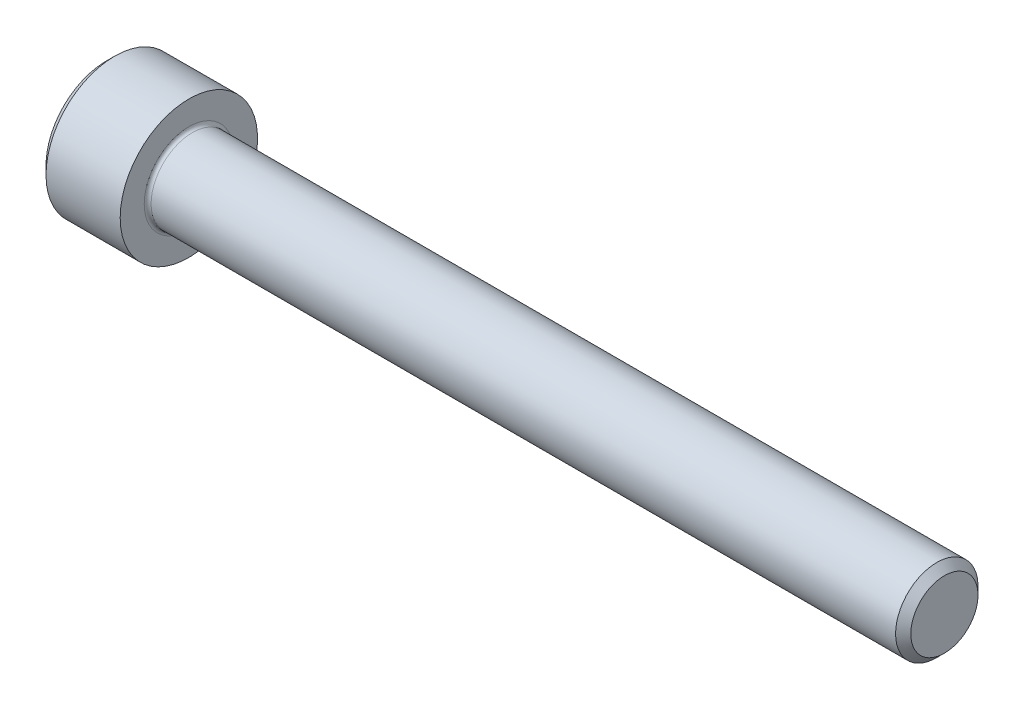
ISO-10303-21;
HEADER;
FILE_DESCRIPTION(('STEP AP214'),'2;1');
FILE_NAME('part.step','',(''),(''),'','','');
FILE_SCHEMA(('AUTOMOTIVE_DESIGN { 1 0 10303 214 1 1 1 1 }'));
ENDSEC;
DATA;
#1=APPLICATION_CONTEXT('core data for automotive mechanical design processes');
#2=APPLICATION_PROTOCOL_DEFINITION('international standard','automotive_design',2000,#1);
#3=PRODUCT_CONTEXT('',#1,'mechanical');
#4=PRODUCT('Part','Part','',(#3));
#5=PRODUCT_RELATED_PRODUCT_CATEGORY('part','',(#4));
#6=PRODUCT_DEFINITION_FORMATION('','',#4);
#7=PRODUCT_DEFINITION_CONTEXT('part definition',#1,'design');
#8=PRODUCT_DEFINITION('design','',#6,#7);
#9=PRODUCT_DEFINITION_SHAPE('','',#8);
#10=(LENGTH_UNIT() NAMED_UNIT(*) SI_UNIT(.MILLI.,.METRE.));
#11=(NAMED_UNIT(*) PLANE_ANGLE_UNIT() SI_UNIT($,.RADIAN.));
#12=(NAMED_UNIT(*) SI_UNIT($,.STERADIAN.) SOLID_ANGLE_UNIT());
#13=UNCERTAINTY_MEASURE_WITH_UNIT(LENGTH_MEASURE(1.E-05),#10,'distance_accuracy_value','');
#14=(GEOMETRIC_REPRESENTATION_CONTEXT(3) GLOBAL_UNCERTAINTY_ASSIGNED_CONTEXT((#13)) GLOBAL_UNIT_ASSIGNED_CONTEXT((#10,
#11,#12)) REPRESENTATION_CONTEXT('',''));
#15=CARTESIAN_POINT('',(0.,0.,0.));
#16=DIRECTION('',(0.,0.,1.));
#17=DIRECTION('',(1.,0.,0.));
#18=AXIS2_PLACEMENT_3D('',#15,#16,#17);
#19=CARTESIAN_POINT('',(3.,2.93524876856,0.));
#20=DIRECTION('',(1.,0.,0.));
#21=DIRECTION('',(0.,0.,-1.));
#22=AXIS2_PLACEMENT_3D('',#19,#20,#21);
#23=PLANE('',#22);
#24=DIRECTION('',(0.,1.,0.));
#25=VECTOR('',#24,1.);
#26=CARTESIAN_POINT('',(3.,2.93524876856,2.542));
#27=LINE('',#26,#25);
#28=CARTESIAN_POINT('',(2.99999999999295,3.14920181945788E-10,2.54200000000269));
#29=VERTEX_POINT('',#28);
#30=CARTESIAN_POINT('',(3.,-1.46762438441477,2.54199999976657));
#31=VERTEX_POINT('',#30);
#32=EDGE_CURVE('E96',#29,#31,#27,.F.);
#33=ORIENTED_EDGE('',*,*,#32,.F.);
#34=CARTESIAN_POINT('',(2.9999999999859,0.,0.));
#35=DIRECTION('',(-1.,0.,0.));
#36=DIRECTION('',(0.,0.,1.));
#37=AXIS2_PLACEMENT_3D('',#34,#35,#36);
#38=CIRCLE('',#37,2.54200000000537);
#39=CARTESIAN_POINT('',(2.99999999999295,-2.2014365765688,1.27099999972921));
#40=VERTEX_POINT('',#39);
#41=EDGE_CURVE('E98',#29,#40,#38,.F.);
#42=ORIENTED_EDGE('',*,*,#41,.T.);
#43=DIRECTION('',(0.,-0.499999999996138,-0.866025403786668));
#44=VECTOR('',#43,1.);
#45=CARTESIAN_POINT('',(3.,-1.46762438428,2.542));
#46=LINE('',#45,#44);
#47=EDGE_CURVE('E101',#31,#40,#46,.T.);
#48=ORIENTED_EDGE('',*,*,#47,.F.);
#49=EDGE_LOOP('',(#33,#42,#48));
#50=FACE_BOUND('',#49,.T.);
#51=ADVANCED_FACE('F17',(#50),#23,.F.);
#52=CARTESIAN_POINT('',(3.,2.93524876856,0.));
#53=DIRECTION('',(1.,0.,0.));
#54=DIRECTION('',(0.,0.,-1.));
#55=AXIS2_PLACEMENT_3D('',#52,#53,#54);
#56=PLANE('',#55);
#57=DIRECTION('',(0.,-0.500000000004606,-0.86602540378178));
#58=VECTOR('',#57,1.);
#59=CARTESIAN_POINT('',(3.,-2.20143657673,1.27099999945));
#60=LINE('',#59,#58);
#61=CARTESIAN_POINT('',(3.,-2.93524876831,2.61520596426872E-10));
#62=VERTEX_POINT('',#61);
#63=EDGE_CURVE('E169',#40,#62,#60,.T.);
#64=ORIENTED_EDGE('',*,*,#63,.F.);
#65=CARTESIAN_POINT('',(2.9999999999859,0.,0.));
#66=DIRECTION('',(-1.,0.,0.));
#67=DIRECTION('',(0.,0.,1.));
#68=AXIS2_PLACEMENT_3D('',#65,#66,#67);
#69=CIRCLE('',#68,2.54200000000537);
#70=CARTESIAN_POINT('',(2.99999999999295,-2.20143657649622,-1.27099999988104));
#71=VERTEX_POINT('',#70);
#72=EDGE_CURVE('E116',#40,#71,#69,.F.);
#73=ORIENTED_EDGE('',*,*,#72,.T.);
#74=DIRECTION('',(0.,0.499999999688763,-0.866025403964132));
#75=VECTOR('',#74,1.);
#76=CARTESIAN_POINT('',(3.,-2.93524876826,5.22184517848E-10));
#77=LINE('',#76,#75);
#78=EDGE_CURVE('E165',#62,#71,#77,.T.);
#79=ORIENTED_EDGE('',*,*,#78,.F.);
#80=EDGE_LOOP('',(#64,#73,#79));
#81=FACE_BOUND('',#80,.T.);
#82=ADVANCED_FACE('F341',(#81),#56,.F.);
#83=CARTESIAN_POINT('',(3.,2.93524876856,0.));
#84=DIRECTION('',(1.,0.,0.));
#85=DIRECTION('',(0.,0.,-1.));
#86=AXIS2_PLACEMENT_3D('',#83,#84,#85);
#87=PLANE('',#86);
#88=DIRECTION('',(0.,0.50000000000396,-0.866025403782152));
#89=VECTOR('',#88,1.);
#90=CARTESIAN_POINT('',(3.,-2.20143657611,-1.27100000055));
#91=LINE('',#90,#89);
#92=CARTESIAN_POINT('',(3.,-1.46762438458,-2.54199999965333));
#93=VERTEX_POINT('',#92);
#94=EDGE_CURVE('E161',#71,#93,#91,.T.);
#95=ORIENTED_EDGE('',*,*,#94,.F.);
#96=CARTESIAN_POINT('',(2.9999999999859,0.,0.));
#97=DIRECTION('',(-1.,0.,0.));
#98=DIRECTION('',(0.,0.,1.));
#99=AXIS2_PLACEMENT_3D('',#96,#97,#98);
#100=CIRCLE('',#99,2.54200000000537);
#101=CARTESIAN_POINT('',(2.9999999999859,-3.14923168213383E-10,-2.54199999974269));
#102=VERTEX_POINT('',#101);
#103=EDGE_CURVE('E218',#71,#102,#100,.F.);
#104=ORIENTED_EDGE('',*,*,#103,.T.);
#105=DIRECTION('',(0.,1.,0.));
#106=VECTOR('',#105,1.);
#107=CARTESIAN_POINT('',(3.,2.93524876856,-2.54199999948));
#108=LINE('',#107,#106);
#109=EDGE_CURVE('E157',#93,#102,#108,.T.);
#110=ORIENTED_EDGE('',*,*,#109,.F.);
#111=EDGE_LOOP('',(#95,#104,#110));
#112=FACE_BOUND('',#111,.T.);
#113=ADVANCED_FACE('F338',(#112),#87,.F.);
#114=CARTESIAN_POINT('',(3.,2.93524876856,0.));
#115=DIRECTION('',(1.,0.,0.));
#116=DIRECTION('',(0.,0.,-1.));
#117=AXIS2_PLACEMENT_3D('',#114,#115,#116);
#118=PLANE('',#117);
#119=DIRECTION('',(0.,1.,0.));
#120=VECTOR('',#119,1.);
#121=CARTESIAN_POINT('',(3.,2.93524876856,-2.542));
#122=LINE('',#121,#120);
#123=CARTESIAN_POINT('',(3.,1.46762438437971,-2.54199999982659));
#124=VERTEX_POINT('',#123);
#125=EDGE_CURVE('E153',#102,#124,#122,.T.);
#126=ORIENTED_EDGE('',*,*,#125,.F.);
#127=CARTESIAN_POINT('',(2.9999999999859,0.,0.));
#128=DIRECTION('',(-1.,0.,0.));
#129=DIRECTION('',(0.,0.,1.));
#130=AXIS2_PLACEMENT_3D('',#127,#128,#129);
#131=CIRCLE('',#130,2.54200000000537);
#132=CARTESIAN_POINT('',(2.99999999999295,2.20143657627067,-1.27100000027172));
#133=VERTEX_POINT('',#132);
#134=EDGE_CURVE('E215',#102,#133,#131,.F.);
#135=ORIENTED_EDGE('',*,*,#134,.T.);
#136=DIRECTION('',(0.,0.50000000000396,0.866025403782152));
#137=VECTOR('',#136,1.);
#138=CARTESIAN_POINT('',(3.,1.46762438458,-2.54199999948));
#139=LINE('',#138,#137);
#140=EDGE_CURVE('E149',#124,#133,#139,.T.);
#141=ORIENTED_EDGE('',*,*,#140,.F.);
#142=EDGE_LOOP('',(#126,#135,#141));
#143=FACE_BOUND('',#142,.T.);
#144=ADVANCED_FACE('F334',(#143),#118,.F.);
#145=CARTESIAN_POINT('',(3.,2.93524876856,0.));
#146=DIRECTION('',(1.,0.,0.));
#147=DIRECTION('',(0.,0.,-1.));
#148=AXIS2_PLACEMENT_3D('',#145,#146,#147);
#149=PLANE('',#148);
#150=DIRECTION('',(0.,0.49999999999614,0.866025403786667));
#151=VECTOR('',#150,1.);
#152=CARTESIAN_POINT('',(3.,2.20143657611,-1.27100000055));
#153=LINE('',#152,#151);
#154=CARTESIAN_POINT('',(3.,2.93524876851,-8.66067788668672E-11));
#155=VERTEX_POINT('',#154);
#156=EDGE_CURVE('E145',#133,#155,#153,.T.);
#157=ORIENTED_EDGE('',*,*,#156,.F.);
#158=CARTESIAN_POINT('',(2.9999999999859,0.,0.));
#159=DIRECTION('',(-1.,0.,0.));
#160=DIRECTION('',(0.,0.,1.));
#161=AXIS2_PLACEMENT_3D('',#158,#159,#160);
#162=CIRCLE('',#161,2.54200000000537);
#163=CARTESIAN_POINT('',(2.99999999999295,2.20143657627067,1.27100000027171));
#164=VERTEX_POINT('',#163);
#165=EDGE_CURVE('E124',#133,#164,#162,.F.);
#166=ORIENTED_EDGE('',*,*,#165,.T.);
#167=DIRECTION('',(0.,-0.499999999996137,0.866025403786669));
#168=VECTOR('',#167,1.);
#169=CARTESIAN_POINT('',(3.,2.93524876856,0.));
#170=LINE('',#169,#168);
#171=EDGE_CURVE('E117',#155,#164,#170,.T.);
#172=ORIENTED_EDGE('',*,*,#171,.F.);
#173=EDGE_LOOP('',(#157,#166,#172));
#174=FACE_BOUND('',#173,.T.);
#175=ADVANCED_FACE('F330',(#174),#149,.F.);
#176=CARTESIAN_POINT('',(2.9999999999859,0.,0.));
#177=DIRECTION('',(-1.,0.,0.));
#178=DIRECTION('',(0.,0.,1.));
#179=AXIS2_PLACEMENT_3D('',#176,#177,#178);
#180=CONICAL_SURFACE('',#179,2.54200000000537,1.0471975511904);
#181=CARTESIAN_POINT('',(4.46762438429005,0.,0.));
#182=VERTEX_POINT('',#181);
#183=VERTEX_LOOP('',#182);
#184=FACE_BOUND('',#183,.T.);
#185=ORIENTED_EDGE('',*,*,#41,.F.);
#186=CARTESIAN_POINT('',(2.9999999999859,0.,0.));
#187=DIRECTION('',(-1.,0.,0.));
#188=DIRECTION('',(0.,0.,1.));
#189=AXIS2_PLACEMENT_3D('',#186,#187,#188);
#190=CIRCLE('',#189,2.54200000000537);
#191=EDGE_CURVE('E112',#29,#164,#190,.T.);
#192=ORIENTED_EDGE('',*,*,#191,.T.);
#193=ORIENTED_EDGE('',*,*,#165,.F.);
#194=ORIENTED_EDGE('',*,*,#134,.F.);
#195=ORIENTED_EDGE('',*,*,#103,.F.);
#196=ORIENTED_EDGE('',*,*,#72,.F.);
#197=EDGE_LOOP('',(#185,#192,#193,#194,#195,#196));
#198=FACE_BOUND('',#197,.T.);
#199=ADVANCED_FACE('F110',(#184,#198),#180,.F.);
#200=CARTESIAN_POINT('',(3.,2.93524876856,0.));
#201=DIRECTION('',(1.,0.,0.));
#202=DIRECTION('',(0.,0.,-1.));
#203=AXIS2_PLACEMENT_3D('',#200,#201,#202);
#204=PLANE('',#203);
#205=DIRECTION('',(0.,0.50000000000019,-0.866025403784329));
#206=VECTOR('',#205,1.);
#207=CARTESIAN_POINT('',(3.,2.93524876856,0.));
#208=LINE('',#207,#206);
#209=CARTESIAN_POINT('',(3.,1.46762438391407,2.54200000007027));
#210=VERTEX_POINT('',#209);
#211=EDGE_CURVE('E123',#164,#210,#208,.F.);
#212=ORIENTED_EDGE('',*,*,#211,.F.);
#213=ORIENTED_EDGE('',*,*,#191,.F.);
#214=DIRECTION('',(0.,-1.,0.));
#215=VECTOR('',#214,1.);
#216=CARTESIAN_POINT('',(3.,-1.46762438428,2.542));
#217=LINE('',#216,#215);
#218=EDGE_CURVE('E121',#29,#210,#217,.F.);
#219=ORIENTED_EDGE('',*,*,#218,.T.);
#220=EDGE_LOOP('',(#212,#213,#219));
#221=FACE_BOUND('',#220,.T.);
#222=ADVANCED_FACE('F120',(#221),#204,.F.);
#223=CARTESIAN_POINT('',(3.,2.93524876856,0.));
#224=DIRECTION('',(0.,-0.866025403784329,-0.50000000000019));
#225=DIRECTION('',(0.,0.50000000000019,-0.866025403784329));
#226=AXIS2_PLACEMENT_3D('',#223,#224,#225);
#227=PLANE('',#226);
#228=ORIENTED_EDGE('',*,*,#211,.T.);
#229=DIRECTION('',(1.,0.,0.));
#230=VECTOR('',#229,1.);
#231=CARTESIAN_POINT('',(3.,1.46762438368,2.542));
#232=LINE('',#231,#230);
#233=CARTESIAN_POINT('',(0.,1.46762438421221,2.54199999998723));
#234=VERTEX_POINT('',#233);
#235=EDGE_CURVE('E129',#210,#234,#232,.F.);
#236=ORIENTED_EDGE('',*,*,#235,.T.);
#237=DIRECTION('',(0.,-0.499999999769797,0.866025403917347));
#238=VECTOR('',#237,1.);
#239=CARTESIAN_POINT('',(0.,2.93524876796,0.));
#240=LINE('',#239,#238);
#241=CARTESIAN_POINT('',(0.,2.9352487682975,6.49506382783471E-11));
#242=VERTEX_POINT('',#241);
#243=EDGE_CURVE('E136',#242,#234,#240,.T.);
#244=ORIENTED_EDGE('',*,*,#243,.F.);
#245=DIRECTION('',(1.,0.,0.));
#246=VECTOR('',#245,1.);
#247=CARTESIAN_POINT('',(3.,2.93524876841,-2.5980895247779E-10));
#248=LINE('',#247,#246);
#249=EDGE_CURVE('E180',#242,#155,#248,.T.);
#250=ORIENTED_EDGE('',*,*,#249,.T.);
#251=ORIENTED_EDGE('',*,*,#171,.T.);
#252=EDGE_LOOP('',(#228,#236,#244,#250,#251));
#253=FACE_BOUND('',#252,.T.);
#254=ADVANCED_FACE('F322',(#253),#227,.T.);
#255=CARTESIAN_POINT('',(3.,-1.46762438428,2.542));
#256=DIRECTION('',(0.,0.,1.));
#257=DIRECTION('',(0.,-1.,0.));
#258=AXIS2_PLACEMENT_3D('',#255,#256,#257);
#259=PLANE('',#258);
#260=ORIENTED_EDGE('',*,*,#235,.F.);
#261=ORIENTED_EDGE('',*,*,#218,.F.);
#262=ORIENTED_EDGE('',*,*,#32,.T.);
#263=DIRECTION('',(1.,0.,0.));
#264=VECTOR('',#263,1.);
#265=CARTESIAN_POINT('',(3.,-1.46762438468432,2.5419999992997));
#266=LINE('',#265,#264);
#267=CARTESIAN_POINT('',(0.,-1.46762438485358,2.54199999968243));
#268=VERTEX_POINT('',#267);
#269=EDGE_CURVE('E131',#268,#31,#266,.T.);
#270=ORIENTED_EDGE('',*,*,#269,.F.);
#271=DIRECTION('',(0.,1.,0.));
#272=VECTOR('',#271,1.);
#273=CARTESIAN_POINT('',(0.,0.,2.54199999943));
#274=LINE('',#273,#272);
#275=EDGE_CURVE('E364',#234,#268,#274,.F.);
#276=ORIENTED_EDGE('',*,*,#275,.F.);
#277=EDGE_LOOP('',(#260,#261,#262,#270,#276));
#278=FACE_BOUND('',#277,.T.);
#279=ADVANCED_FACE('F127',(#278),#259,.F.);
#280=CARTESIAN_POINT('',(3.,-1.46762438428,2.542));
#281=DIRECTION('',(0.,0.866025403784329,-0.50000000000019));
#282=DIRECTION('',(0.,0.50000000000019,0.866025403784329));
#283=AXIS2_PLACEMENT_3D('',#280,#281,#282);
#284=PLANE('',#283);
#285=ORIENTED_EDGE('',*,*,#63,.T.);
#286=DIRECTION('',(1.,0.,0.));
#287=VECTOR('',#286,1.);
#288=CARTESIAN_POINT('',(3.,-2.93524876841,-2.59807231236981E-10));
#289=LINE('',#288,#287);
#290=CARTESIAN_POINT('',(0.,-2.93524876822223,1.95986312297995E-10));
#291=VERTEX_POINT('',#290);
#292=EDGE_CURVE('E191',#291,#62,#289,.T.);
#293=ORIENTED_EDGE('',*,*,#292,.F.);
#294=DIRECTION('',(0.,-0.499999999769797,-0.866025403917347));
#295=VECTOR('',#294,1.);
#296=CARTESIAN_POINT('',(0.,-1.46762438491,2.54199999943));
#297=LINE('',#296,#295);
#298=EDGE_CURVE('E359',#268,#291,#297,.T.);
#299=ORIENTED_EDGE('',*,*,#298,.F.);
#300=ORIENTED_EDGE('',*,*,#269,.T.);
#301=ORIENTED_EDGE('',*,*,#47,.T.);
#302=EDGE_LOOP('',(#285,#293,#299,#300,#301));
#303=FACE_BOUND('',#302,.T.);
#304=ADVANCED_FACE('F315',(#303),#284,.T.);
#305=CARTESIAN_POINT('',(3.,-2.93524876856,0.));
#306=DIRECTION('',(0.,0.866025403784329,0.50000000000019));
#307=DIRECTION('',(0.,-0.50000000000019,0.866025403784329));
#308=AXIS2_PLACEMENT_3D('',#305,#306,#307);
#309=PLANE('',#308);
#310=ORIENTED_EDGE('',*,*,#94,.T.);
#311=DIRECTION('',(1.,0.,0.));
#312=VECTOR('',#311,1.);
#313=CARTESIAN_POINT('',(3.,-1.46762438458,-2.542));
#314=LINE('',#313,#312);
#315=CARTESIAN_POINT('',(0.,-1.46762438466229,-2.54199999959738));
#316=VERTEX_POINT('',#315);
#317=EDGE_CURVE('E184',#93,#316,#314,.F.);
#318=ORIENTED_EDGE('',*,*,#317,.T.);
#319=DIRECTION('',(0.,0.499999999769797,-0.866025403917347));
#320=VECTOR('',#319,1.);
#321=CARTESIAN_POINT('',(0.,-2.93524876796,0.));
#322=LINE('',#321,#320);
#323=EDGE_CURVE('E353',#291,#316,#322,.T.);
#324=ORIENTED_EDGE('',*,*,#323,.F.);
#325=ORIENTED_EDGE('',*,*,#292,.T.);
#326=ORIENTED_EDGE('',*,*,#78,.T.);
#327=EDGE_LOOP('',(#310,#318,#324,#325,#326));
#328=FACE_BOUND('',#327,.T.);
#329=ADVANCED_FACE('F311',(#328),#309,.T.);
#330=CARTESIAN_POINT('',(3.,1.46762438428,-2.542));
#331=DIRECTION('',(0.,0.,-1.));
#332=DIRECTION('',(0.,1.,0.));
#333=AXIS2_PLACEMENT_3D('',#330,#331,#332);
#334=PLANE('',#333);
#335=ORIENTED_EDGE('',*,*,#317,.F.);
#336=ORIENTED_EDGE('',*,*,#109,.T.);
#337=ORIENTED_EDGE('',*,*,#125,.T.);
#338=DIRECTION('',(1.,0.,0.));
#339=VECTOR('',#338,1.);
#340=CARTESIAN_POINT('',(3.,1.46762438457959,-2.54199999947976));
#341=LINE('',#340,#339);
#342=CARTESIAN_POINT('',(0.,1.4676243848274,-2.54199999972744));
#343=VERTEX_POINT('',#342);
#344=EDGE_CURVE('E183',#124,#343,#341,.F.);
#345=ORIENTED_EDGE('',*,*,#344,.T.);
#346=DIRECTION('',(0.,1.,0.));
#347=VECTOR('',#346,1.);
#348=CARTESIAN_POINT('',(0.,0.,-2.54199999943));
#349=LINE('',#348,#347);
#350=EDGE_CURVE('E358',#316,#343,#349,.T.);
#351=ORIENTED_EDGE('',*,*,#350,.F.);
#352=EDGE_LOOP('',(#335,#336,#337,#345,#351));
#353=FACE_BOUND('',#352,.T.);
#354=ADVANCED_FACE('F307',(#353),#334,.F.);
#355=CARTESIAN_POINT('',(3.,2.93524876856,0.));
#356=DIRECTION('',(0.,0.866025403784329,-0.50000000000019));
#357=DIRECTION('',(0.,0.50000000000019,0.866025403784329));
#358=AXIS2_PLACEMENT_3D('',#355,#356,#357);
#359=PLANE('',#358);
#360=ORIENTED_EDGE('',*,*,#344,.F.);
#361=ORIENTED_EDGE('',*,*,#140,.T.);
#362=ORIENTED_EDGE('',*,*,#156,.T.);
#363=ORIENTED_EDGE('',*,*,#249,.F.);
#364=DIRECTION('',(0.,0.499999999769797,0.866025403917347));
#365=VECTOR('',#364,1.);
#366=CARTESIAN_POINT('',(0.,1.46762438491,-2.54199999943));
#367=LINE('',#366,#365);
#368=EDGE_CURVE('E211',#343,#242,#367,.T.);
#369=ORIENTED_EDGE('',*,*,#368,.F.);
#370=EDGE_LOOP('',(#360,#361,#362,#363,#369));
#371=FACE_BOUND('',#370,.T.);
#372=ADVANCED_FACE('F303',(#371),#359,.F.);
#373=CARTESIAN_POINT('',(0.,0.,0.));
#374=DIRECTION('',(-1.,0.,0.));
#375=DIRECTION('',(0.,0.,1.));
#376=AXIS2_PLACEMENT_3D('',#373,#374,#375);
#377=PLANE('',#376);
#378=ORIENTED_EDGE('',*,*,#350,.T.);
#379=ORIENTED_EDGE('',*,*,#368,.T.);
#380=ORIENTED_EDGE('',*,*,#243,.T.);
#381=ORIENTED_EDGE('',*,*,#275,.T.);
#382=ORIENTED_EDGE('',*,*,#298,.T.);
#383=ORIENTED_EDGE('',*,*,#323,.T.);
#384=EDGE_LOOP('',(#378,#379,#380,#381,#382,#383));
#385=FACE_BOUND('',#384,.T.);
#386=CARTESIAN_POINT('',(0.,0.,0.));
#387=DIRECTION('',(1.,0.,0.));
#388=DIRECTION('',(0.,0.,-1.));
#389=AXIS2_PLACEMENT_3D('',#386,#387,#388);
#390=CIRCLE('',#389,4.39999999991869);
#391=CARTESIAN_POINT('',(0.,0.,-4.39999999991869));
#392=VERTEX_POINT('',#391);
#393=EDGE_CURVE('E209',#392,#392,#390,.T.);
#394=ORIENTED_EDGE('',*,*,#393,.F.);
#395=EDGE_LOOP('',(#394));
#396=FACE_BOUND('',#395,.T.);
#397=ADVANCED_FACE('F295',(#385,#396),#377,.T.);
#398=CARTESIAN_POINT('',(0.599999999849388,0.,0.));
#399=DIRECTION('',(1.,0.,0.));
#400=DIRECTION('',(0.,0.,-1.));
#401=AXIS2_PLACEMENT_3D('',#398,#399,#400);
#402=CONICAL_SURFACE('',#401,4.99999999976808,0.785398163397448);
#403=ORIENTED_EDGE('',*,*,#393,.T.);
#404=EDGE_LOOP('',(#403));
#405=FACE_BOUND('',#404,.T.);
#406=CARTESIAN_POINT('',(0.600000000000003,0.,0.));
#407=DIRECTION('',(-1.,0.,0.));
#408=DIRECTION('',(0.,0.,1.));
#409=AXIS2_PLACEMENT_3D('',#406,#407,#408);
#410=CIRCLE('',#409,5.);
#411=CARTESIAN_POINT('',(0.600000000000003,0.,5.));
#412=VERTEX_POINT('',#411);
#413=EDGE_CURVE('E208',#412,#412,#410,.F.);
#414=ORIENTED_EDGE('',*,*,#413,.F.);
#415=EDGE_LOOP('',(#414));
#416=FACE_BOUND('',#415,.T.);
#417=ADVANCED_FACE('F290',(#405,#416),#402,.T.);
#418=CARTESIAN_POINT('',(-31.75,0.,0.));
#419=DIRECTION('',(-1.,0.,0.));
#420=DIRECTION('',(0.,0.,1.));
#421=AXIS2_PLACEMENT_3D('',#418,#419,#420);
#422=CYLINDRICAL_SURFACE('',#421,5.);
#423=CARTESIAN_POINT('',(6.,0.,0.));
#424=DIRECTION('',(-1.,0.,0.));
#425=DIRECTION('',(0.,0.,1.));
#426=AXIS2_PLACEMENT_3D('',#423,#424,#425);
#427=CIRCLE('',#426,5.);
#428=CARTESIAN_POINT('',(6.,0.,5.));
#429=VERTEX_POINT('',#428);
#430=EDGE_CURVE('E205',#429,#429,#427,.F.);
#431=ORIENTED_EDGE('',*,*,#430,.F.);
#432=EDGE_LOOP('',(#431));
#433=FACE_BOUND('',#432,.T.);
#434=ORIENTED_EDGE('',*,*,#413,.T.);
#435=EDGE_LOOP('',(#434));
#436=FACE_BOUND('',#435,.T.);
#437=ADVANCED_FACE('F286',(#433,#436),#422,.T.);
#438=CARTESIAN_POINT('',(61.,2.4455,0.));
#439=DIRECTION('',(1.,0.,0.));
#440=DIRECTION('',(0.,0.,-1.));
#441=AXIS2_PLACEMENT_3D('',#438,#439,#440);
#442=PLANE('',#441);
#443=CARTESIAN_POINT('',(60.9999999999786,0.,0.));
#444=DIRECTION('',(-1.,0.,0.));
#445=DIRECTION('',(0.,0.,1.));
#446=AXIS2_PLACEMENT_3D('',#443,#444,#445);
#447=CIRCLE('',#446,2.4454999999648);
#448=CARTESIAN_POINT('',(60.9999999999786,0.,2.4454999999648));
#449=VERTEX_POINT('',#448);
#450=EDGE_CURVE('E201',#449,#449,#447,.T.);
#451=ORIENTED_EDGE('',*,*,#450,.F.);
#452=EDGE_LOOP('',(#451));
#453=FACE_BOUND('',#452,.T.);
#454=ADVANCED_FACE('F245',(#453),#442,.T.);
#455=CARTESIAN_POINT('',(6.,5.,0.));
#456=DIRECTION('',(1.,0.,0.));
#457=DIRECTION('',(0.,0.,-1.));
#458=AXIS2_PLACEMENT_3D('',#455,#456,#457);
#459=PLANE('',#458);
#460=CARTESIAN_POINT('',(6.,0.,3.25));
#461=CARTESIAN_POINT('',(6.00000000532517,-0.0425763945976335,3.24998718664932));
#462=CARTESIAN_POINT('',(6.00000000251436,-0.0851521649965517,3.24914609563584));
#463=CARTESIAN_POINT('',(5.99999999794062,-0.170236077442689,3.24581345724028));
#464=CARTESIAN_POINT('',(5.99999999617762,-0.212744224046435,3.24332202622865));
#465=CARTESIAN_POINT('',(6.00000001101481,-0.297630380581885,3.23669497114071));
#466=CARTESIAN_POINT('',(6.00000002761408,-0.340008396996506,3.23255943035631));
#467=CARTESIAN_POINT('',(6.00000007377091,-0.424568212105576,3.22263708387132));
#468=CARTESIAN_POINT('',(6.00000010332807,-0.46675001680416,3.2168503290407));
#469=CARTESIAN_POINT('',(6.0000003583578,-0.550866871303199,3.20368621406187));
#470=CARTESIAN_POINT('',(6.00000058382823,-0.592801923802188,3.19630887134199));
#471=CARTESIAN_POINT('',(6.00000074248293,-0.660206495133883,3.18296934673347));
#472=CARTESIAN_POINT('',(6.00000075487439,-0.685786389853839,3.17755934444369));
#473=CARTESIAN_POINT('',(6.00000070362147,-0.757853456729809,3.16137245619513));
#474=CARTESIAN_POINT('',(6.00000056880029,-0.804175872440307,3.1498505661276));
#475=CARTESIAN_POINT('',(6.00000037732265,-0.881045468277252,3.12891688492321));
#476=CARTESIAN_POINT('',(6.0000003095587,-0.911747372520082,3.12006594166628));
#477=CARTESIAN_POINT('',(6.00000019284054,-0.971970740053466,3.10173621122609));
#478=CARTESIAN_POINT('',(6.00000014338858,-1.00150022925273,3.09228379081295));
#479=CARTESIAN_POINT('',(6.00000004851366,-1.07595008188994,3.06727588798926));
#480=CARTESIAN_POINT('',(6.00000001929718,-1.12068186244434,3.05115352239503));
#481=CARTESIAN_POINT('',(6.00000000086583,-1.19139695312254,3.0239206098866));
#482=CARTESIAN_POINT('',(6.00000000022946,-1.21762221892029,3.01343120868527));
#483=CARTESIAN_POINT('',(5.99999999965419,-1.28303073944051,2.98630750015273));
#484=CARTESIAN_POINT('',(6.00000000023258,-1.3220416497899,2.96925430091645));
#485=CARTESIAN_POINT('',(5.99999999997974,-1.39936413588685,2.93363820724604));
#486=CARTESIAN_POINT('',(5.9999999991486,-1.43767575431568,2.91507540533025));
#487=CARTESIAN_POINT('',(6.00000002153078,-1.51355069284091,2.87648154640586));
#488=CARTESIAN_POINT('',(6.00000004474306,-1.55111404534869,2.85645055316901));
#489=CARTESIAN_POINT('',(6.00000010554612,-1.62542686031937,2.81493620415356));
#490=CARTESIAN_POINT('',(6.00000014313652,-1.66217634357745,2.79345288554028));
#491=CARTESIAN_POINT('',(6.00000041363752,-1.73483768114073,2.74910938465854));
#492=CARTESIAN_POINT('',(6.0000006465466,-1.77074954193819,2.72624921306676));
#493=CARTESIAN_POINT('',(6.00000080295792,-1.8279586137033,2.68810209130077));
#494=CARTESIAN_POINT('',(6.00000081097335,-1.84956797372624,2.67328132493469));
#495=CARTESIAN_POINT('',(6.00000074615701,-1.90998924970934,2.63071737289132));
#496=CARTESIAN_POINT('',(6.00000060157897,-1.94836508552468,2.60235080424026));
#497=CARTESIAN_POINT('',(6.00000039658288,-2.01133484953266,2.55361779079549));
#498=CARTESIAN_POINT('',(6.00000032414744,-2.03628666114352,2.53371064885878));
#499=CARTESIAN_POINT('',(6.00000020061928,-2.08465109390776,2.49394203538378));
#500=CARTESIAN_POINT('',(6.00000014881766,-2.10808611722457,2.47410780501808));
#501=CARTESIAN_POINT('',(6.00000004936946,-2.16697759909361,2.42282018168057));
#502=CARTESIAN_POINT('',(6.0000000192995,-2.20204149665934,2.39091337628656));
#503=CARTESIAN_POINT('',(6.0000000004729,-2.25722218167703,2.338479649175));
#504=CARTESIAN_POINT('',(6.00000000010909,-2.27778663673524,2.31842030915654));
#505=CARTESIAN_POINT('',(5.99999999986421,-2.32817760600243,2.26798939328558));
#506=CARTESIAN_POINT('',(6.00000000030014,-2.35769325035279,2.23730550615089));
#507=CARTESIAN_POINT('',(5.99999999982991,-2.41550068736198,2.17481052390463));
#508=CARTESIAN_POINT('',(5.99999999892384,-2.44379255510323,2.14299949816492));
#509=CARTESIAN_POINT('',(6.00000002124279,-2.49912306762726,2.07830732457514));
#510=CARTESIAN_POINT('',(6.00000004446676,-2.52616176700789,2.0454262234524));
#511=CARTESIAN_POINT('',(6.00000010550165,-2.5789314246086,1.97863366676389));
#512=CARTESIAN_POINT('',(6.00000014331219,-2.60466241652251,1.94472223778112));
#513=CARTESIAN_POINT('',(6.00000041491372,-2.65482362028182,1.87594786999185));
#514=CARTESIAN_POINT('',(6.00000064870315,-2.67925384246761,1.84108493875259));
#515=CARTESIAN_POINT('',(6.00000080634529,-2.71752290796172,1.78392958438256));
#516=CARTESIAN_POINT('',(6.00000081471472,-2.73182804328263,1.7619480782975));
#517=CARTESIAN_POINT('',(6.00000075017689,-2.77136804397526,1.69948869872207));
#518=CARTESIAN_POINT('',(6.00000060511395,-2.79596216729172,1.65860224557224));
#519=CARTESIAN_POINT('',(6.00000039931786,-2.83547615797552,1.58950167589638));
#520=CARTESIAN_POINT('',(6.00000032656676,-2.85090253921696,1.56157499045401));
#521=CARTESIAN_POINT('',(6.00000020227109,-2.88038482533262,1.50629086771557));
#522=CARTESIAN_POINT('',(6.00000015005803,-2.89447006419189,1.47894907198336));
#523=CARTESIAN_POINT('',(6.00000004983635,-2.92928428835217,1.40895374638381));
#524=CARTESIAN_POINT('',(6.00000001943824,-2.94947738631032,1.36603173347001));
#525=CARTESIAN_POINT('',(6.00000000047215,-2.980363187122,1.29652211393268));
#526=CARTESIAN_POINT('',(6.00000000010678,-2.99165160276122,1.2701965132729));
#527=CARTESIAN_POINT('',(5.99999999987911,-3.01887545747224,1.20439693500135));
#528=CARTESIAN_POINT('',(6.00000000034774,-3.03440220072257,1.16475256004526));
#529=CARTESIAN_POINT('',(5.99999999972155,-3.06389369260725,1.08489082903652));
#530=CARTESIAN_POINT('',(5.99999999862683,-3.07785853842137,1.04467350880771));
#531=CARTESIAN_POINT('',(6.0000000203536,-3.1042209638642,0.963729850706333));
#532=CARTESIAN_POINT('',(6.00000004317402,-3.11661861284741,0.923003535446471));
#533=CARTESIAN_POINT('',(6.00000010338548,-3.13981148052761,0.841099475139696));
#534=CARTESIAN_POINT('',(6.00000014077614,-3.15060674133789,0.799921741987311));
#535=CARTESIAN_POINT('',(6.00000041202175,-3.17063151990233,0.7171850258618));
#536=CARTESIAN_POINT('',(6.00000064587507,-3.17986105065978,0.675626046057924));
#537=CARTESIAN_POINT('',(6.00000080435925,-3.19334420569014,0.60818018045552));
#538=CARTESIAN_POINT('',(6.00000081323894,-3.19814778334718,0.58240213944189));
#539=CARTESIAN_POINT('',(6.00000075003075,-3.21077584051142,0.509569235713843));
#540=CARTESIAN_POINT('',(6.00000060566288,-3.21785180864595,0.462382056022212));
#541=CARTESIAN_POINT('',(6.00000040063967,-3.22791536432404,0.383415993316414));
#542=CARTESIAN_POINT('',(6.00000032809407,-3.23148088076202,0.351708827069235));
#543=CARTESIAN_POINT('',(6.00000020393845,-3.23756532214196,0.289325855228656));
#544=CARTESIAN_POINT('',(6.00000015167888,-3.2401167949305,0.258653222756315));
#545=CARTESIAN_POINT('',(6.00000005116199,-3.2454956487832,0.180630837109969));
#546=CARTESIAN_POINT('',(6.00000002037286,-3.24772521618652,0.133238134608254));
#547=CARTESIAN_POINT('',(6.0000000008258,-3.24965765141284,0.0572242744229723));
#548=CARTESIAN_POINT('',(6.00000000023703,-3.25001209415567,0.0286172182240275));
#549=CARTESIAN_POINT('',(5.99999999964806,-3.2499815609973,-0.04248820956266));
#550=CARTESIAN_POINT('',(6.00000000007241,-3.2491540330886,-0.0849876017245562));
#551=CARTESIAN_POINT('',(6.00000000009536,-3.24583280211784,-0.169919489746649));
#552=CARTESIAN_POINT('',(5.99999999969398,-3.2433391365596,-0.21235198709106));
#553=CARTESIAN_POINT('',(6.00000000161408,-3.2367026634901,-0.29708735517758));
#554=CARTESIAN_POINT('',(6.00000000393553,-3.23255987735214,-0.339390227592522));
#555=CARTESIAN_POINT('',(6.00000001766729,-3.22262781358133,-0.423802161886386));
#556=CARTESIAN_POINT('',(6.00000002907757,-3.21683854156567,-0.465911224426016));
#557=CARTESIAN_POINT('',(6.00000007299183,-3.20362391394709,-0.549871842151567));
#558=CARTESIAN_POINT('',(6.00000010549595,-3.19619854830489,-0.591723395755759));
#559=CARTESIAN_POINT('',(6.00000020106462,-3.17972020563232,-0.675106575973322));
#560=CARTESIAN_POINT('',(6.00000026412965,-3.17066720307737,-0.716638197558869));
#561=CARTESIAN_POINT('',(6.00000041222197,-3.15558247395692,-0.779912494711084));
#562=CARTESIAN_POINT('',(6.00000047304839,-3.1501270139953,-0.80179405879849));
#563=CARTESIAN_POINT('',(6.00000058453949,-3.13939550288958,-0.842980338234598));
#564=CARTESIAN_POINT('',(6.00000063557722,-3.13416840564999,-0.86229780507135));
#565=CARTESIAN_POINT('',(6.00000073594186,-3.11722263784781,-0.922594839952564));
#566=CARTESIAN_POINT('',(6.0000007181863,-3.10484202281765,-0.96339002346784));
#567=CARTESIAN_POINT('',(6.00000052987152,-3.07845495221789,-1.044435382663));
#568=CARTESIAN_POINT('',(6.00000035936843,-3.06444909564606,-1.08468575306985));
#569=CARTESIAN_POINT('',(6.00000011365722,-3.03774347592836,-1.1563777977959));
#570=CARTESIAN_POINT('',(6.00000002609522,-3.02536174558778,-1.18793860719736));
#571=CARTESIAN_POINT('',(5.99999998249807,-3.00394912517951,-1.24062569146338));
#572=CARTESIAN_POINT('',(5.99999999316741,-2.99512444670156,-1.26183655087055));
#573=CARTESIAN_POINT('',(6.00000001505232,-2.96859722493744,-1.32374030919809));
#574=CARTESIAN_POINT('',(6.00000001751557,-2.95028340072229,-1.36417266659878));
#575=CARTESIAN_POINT('',(6.00000009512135,-2.90003187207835,-1.46937358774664));
#576=CARTESIAN_POINT('',(6.00000021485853,-2.86675076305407,-1.53350843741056));
#577=CARTESIAN_POINT('',(6.0000004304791,-2.81359206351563,-1.62804969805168));
#578=CARTESIAN_POINT('',(6.00000050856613,-2.79528928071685,-1.65935341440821));
#579=CARTESIAN_POINT('',(6.00000062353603,-2.75544976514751,-1.72489642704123));
#580=CARTESIAN_POINT('',(6.00000065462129,-2.73378362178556,-1.75905741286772));
#581=CARTESIAN_POINT('',(6.0000006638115,-2.68813763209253,-1.82810046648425));
#582=CARTESIAN_POINT('',(6.00000063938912,-2.66409706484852,-1.86294235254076));
#583=CARTESIAN_POINT('',(6.00000054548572,-2.61356034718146,-1.93317248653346));
#584=CARTESIAN_POINT('',(6.00000047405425,-2.58700257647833,-1.96851642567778));
#585=CARTESIAN_POINT('',(6.00000030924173,-2.53247045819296,-2.03804096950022));
#586=CARTESIAN_POINT('',(6.00000021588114,-2.50449744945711,-2.0722226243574));
#587=CARTESIAN_POINT('',(6.00000009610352,-2.45051494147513,-2.13552493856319));
#588=CARTESIAN_POINT('',(6.00000006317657,-2.42465415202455,-2.16477267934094));
#589=CARTESIAN_POINT('',(6.00000002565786,-2.37107679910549,-2.22326121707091));
#590=CARTESIAN_POINT('',(6.00000002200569,-2.34332733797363,-2.25247189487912));
#591=CARTESIAN_POINT('',(6.00000002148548,-2.28486478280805,-2.31179750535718));
#592=CARTESIAN_POINT('',(6.00000002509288,-2.25407817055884,-2.34184002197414));
#593=CARTESIAN_POINT('',(6.00000004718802,-2.18936309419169,-2.40256016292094));
#594=CARTESIAN_POINT('',(6.00000006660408,-2.15535915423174,-2.43315742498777));
#595=CARTESIAN_POINT('',(6.0000001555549,-2.08941207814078,-2.49005958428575));
#596=CARTESIAN_POINT('',(6.00000022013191,-2.05758179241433,-2.51649551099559));
#597=CARTESIAN_POINT('',(6.00000039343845,-1.98679960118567,-2.57302563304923));
#598=CARTESIAN_POINT('',(6.00000050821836,-1.9476418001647,-2.60286295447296));
#599=CARTESIAN_POINT('',(6.00000065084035,-1.8733768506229,-2.65678123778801));
#600=CARTESIAN_POINT('',(6.00000068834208,-1.8384382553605,-2.68109490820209));
#601=CARTESIAN_POINT('',(6.00000070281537,-1.76801423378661,-2.72804875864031));
#602=CARTESIAN_POINT('',(6.00000068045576,-1.73253921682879,-2.750704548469));
#603=CARTESIAN_POINT('',(6.00000056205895,-1.65608539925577,-2.79742527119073));
#604=CARTESIAN_POINT('',(6.00000045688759,-1.61498704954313,-2.8212948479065));
#605=CARTESIAN_POINT('',(6.00000026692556,-1.53093339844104,-2.86766341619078));
#606=CARTESIAN_POINT('',(6.00000018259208,-1.48795733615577,-2.89012473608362));
#607=CARTESIAN_POINT('',(6.000000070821,-1.40051501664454,-2.9333855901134));
#608=CARTESIAN_POINT('',(6.00000004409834,-1.35603691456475,-2.9541611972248));
#609=CARTESIAN_POINT('',(6.00000001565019,-1.27356782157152,-2.99045190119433));
#610=CARTESIAN_POINT('',(6.00000001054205,-1.2357101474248,-3.00627076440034));
#611=CARTESIAN_POINT('',(6.00000000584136,-1.16691980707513,-3.03352162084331));
#612=CARTESIAN_POINT('',(6.00000000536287,-1.13608670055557,-3.04520516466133));
#613=CARTESIAN_POINT('',(6.00000001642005,-1.0941250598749,-3.06041100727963));
#614=CARTESIAN_POINT('',(6.000000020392,-1.08313848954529,-3.06432837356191));
#615=CARTESIAN_POINT('',(6.00000003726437,-1.04921840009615,-3.07622035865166));
#616=CARTESIAN_POINT('',(6.00000005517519,-1.02621634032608,-3.08400033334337));
#617=CARTESIAN_POINT('',(6.00000010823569,-0.962725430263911,-3.10467547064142));
#618=CARTESIAN_POINT('',(6.00000014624,-0.922059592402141,-3.11703100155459));
#619=CARTESIAN_POINT('',(6.00000021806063,-0.84027208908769,-3.14012760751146));
#620=CARTESIAN_POINT('',(6.00000025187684,-0.799150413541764,-3.1508686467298));
#621=CARTESIAN_POINT('',(6.00000030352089,-0.716513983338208,-3.17071740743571));
#622=CARTESIAN_POINT('',(6.00000032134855,-0.674999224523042,-3.17982511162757));
#623=CARTESIAN_POINT('',(6.0000003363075,-0.591642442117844,-3.19639336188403));
#624=CARTESIAN_POINT('',(6.0000003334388,-0.549800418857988,-3.20385390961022));
#625=CARTESIAN_POINT('',(6.00000030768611,-0.465854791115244,-3.21711597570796));
#626=CARTESIAN_POINT('',(6.00000028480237,-0.423751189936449,-3.22291751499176));
#627=CARTESIAN_POINT('',(6.0000002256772,-0.339348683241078,-3.23285256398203));
#628=CARTESIAN_POINT('',(6.0000001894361,-0.297049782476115,-3.23698611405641));
#629=CARTESIAN_POINT('',(6.00000011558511,-0.212323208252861,-3.2435786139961));
#630=CARTESIAN_POINT('',(6.00000007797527,-0.169895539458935,-3.24603762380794));
#631=CARTESIAN_POINT('',(6.00000002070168,-0.0849782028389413,-3.24927785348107));
#632=CARTESIAN_POINT('',(6.00000000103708,-0.0424885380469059,-3.2500591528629));
#633=CARTESIAN_POINT('',(6.,0.,-3.25));
#634=B_SPLINE_CURVE_WITH_KNOTS('',3,(#460,#461,#462,#463,#464,#465,#466,#467,#468,#469,#470,
#471,#472,#473,#474,#475,#476,#477,#478,#479,#480,#481,#482,#483,#484,#485,#486,#487,#488,#489,
#490,#491,#492,#493,#494,#495,#496,#497,#498,#499,#500,#501,#502,#503,#504,#505,#506,#507,#508,
#509,#510,#511,#512,#513,#514,#515,#516,#517,#518,#519,#520,#521,#522,#523,#524,#525,#526,#527,
#528,#529,#530,#531,#532,#533,#534,#535,#536,#537,#538,#539,#540,#541,#542,#543,#544,#545,#546,
#547,#548,#549,#550,#551,#552,#553,#554,#555,#556,#557,#558,#559,#560,#561,#562,#563,#564,#565,
#566,#567,#568,#569,#570,#571,#572,#573,#574,#575,#576,#577,#578,#579,#580,#581,#582,#583,#584,
#585,#586,#587,#588,#589,#590,#591,#592,#593,#594,#595,#596,#597,#598,#599,#600,#601,#602,#603,
#604,#605,#606,#607,#608,#609,#610,#611,#612,#613,#614,#615,#616,#617,#618,#619,#620,#621,#622,
#623,#624,#625,#626,#627,#628,#629,#630,#631,#632,#633),.UNSPECIFIED.,.F.,.F.,(4,2,2,2,2,2,2,2,
2,2,2,2,2,2,2,2,2,2,2,2,2,2,2,2,2,2,2,2,2,2,2,2,2,2,2,2,2,2,2,2,2,2,2,2,2,2,2,2,2,2,2,2,2,2,2,2,
2,2,2,2,2,2,2,2,2,2,2,2,2,2,2,2,2,2,2,2,2,2,2,2,2,2,2,2,2,2,4),(0.,0.127720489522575,
0.255431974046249,0.383136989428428,0.510838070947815,0.638537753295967,0.716968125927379,
0.860114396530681,0.955958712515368,1.0489637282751,1.19155726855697,1.27628611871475,
1.40397787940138,1.53166182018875,1.65934021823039,1.78701535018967,1.91468949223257,
1.99329291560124,2.13640300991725,2.23215064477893,2.32424484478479,2.46641746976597,
2.55259298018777,2.68028521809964,2.80796961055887,2.93564843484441,3.06332396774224,
3.19099848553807,3.26967077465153,3.41275592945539,3.50845591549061,3.6007145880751,
3.74296742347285,3.82889158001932,3.95658669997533,4.08427387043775,4.21195538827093,
4.33963354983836,4.46731065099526,4.54596911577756,4.68905823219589,4.78476688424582,
4.87709146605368,5.01937525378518,5.10519586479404,5.23268384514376,5.36016895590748,
5.48765241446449,5.61513543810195,5.74261924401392,5.87010504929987,5.93775488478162,
5.99778819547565,6.12564846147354,6.25346175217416,6.35515455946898,6.42407162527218,
6.55719719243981,6.77377927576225,6.88254834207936,7.00387442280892,7.13083462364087,
7.26342594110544,7.39589408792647,7.51299382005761,7.63383745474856,7.76285241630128,
7.9000416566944,8.02414379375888,8.17177878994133,8.29944372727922,8.42568823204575,
8.56822171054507,8.71364937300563,8.860871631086,8.98393273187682,9.08283472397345,
9.11782653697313,9.19066711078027,9.31813574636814,9.44560721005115,9.57308002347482,
9.70055270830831,9.82802378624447,9.95549177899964,10.0829552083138,10.2104125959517),.UNSPECIFIED.);
#635=CARTESIAN_POINT('',(6.,0.,-3.25));
#636=VERTEX_POINT('',#635);
#637=CARTESIAN_POINT('',(6.,0.,3.25));
#638=VERTEX_POINT('',#637);
#639=EDGE_CURVE('E204',#636,#638,#634,.F.);
#640=ORIENTED_EDGE('',*,*,#639,.T.);
#641=CARTESIAN_POINT('',(6.,0.,0.));
#642=DIRECTION('',(1.,0.,0.));
#643=DIRECTION('',(0.,0.,-1.));
#644=AXIS2_PLACEMENT_3D('',#641,#642,#643);
#645=CIRCLE('',#644,3.25);
#646=EDGE_CURVE('E36',#638,#636,#645,.F.);
#647=ORIENTED_EDGE('',*,*,#646,.T.);
#648=EDGE_LOOP('',(#640,#647));
#649=FACE_BOUND('',#648,.T.);
#650=ORIENTED_EDGE('',*,*,#430,.T.);
#651=EDGE_LOOP('',(#650));
#652=FACE_BOUND('',#651,.T.);
#653=ADVANCED_FACE('F225',(#649,#652),#459,.T.);
#654=CARTESIAN_POINT('',(60.4454999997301,0.,0.));
#655=DIRECTION('',(-1.,0.,0.));
#656=DIRECTION('',(0.,0.,1.));
#657=AXIS2_PLACEMENT_3D('',#654,#655,#656);
#658=CONICAL_SURFACE('',#657,3.00000000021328,0.785398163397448);
#659=CARTESIAN_POINT('',(60.4455,0.,0.));
#660=DIRECTION('',(-1.,0.,0.));
#661=DIRECTION('',(0.,0.,1.));
#662=AXIS2_PLACEMENT_3D('',#659,#660,#661);
#663=CIRCLE('',#662,3.);
#664=CARTESIAN_POINT('',(60.4455,0.,3.));
#665=VERTEX_POINT('',#664);
#666=EDGE_CURVE('E28',#665,#665,#663,.T.);
#667=ORIENTED_EDGE('',*,*,#666,.F.);
#668=EDGE_LOOP('',(#667));
#669=FACE_BOUND('',#668,.T.);
#670=ORIENTED_EDGE('',*,*,#450,.T.);
#671=EDGE_LOOP('',(#670));
#672=FACE_BOUND('',#671,.T.);
#673=ADVANCED_FACE('F244',(#669,#672),#658,.T.);
#674=CARTESIAN_POINT('',(6.25,0.,0.));
#675=DIRECTION('',(1.,0.,0.));
#676=DIRECTION('',(0.,0.,-1.));
#677=AXIS2_PLACEMENT_3D('',#674,#675,#676);
#678=TOROIDAL_SURFACE('',#677,3.25,0.25);
#679=CARTESIAN_POINT('',(6.25,0.,0.));
#680=DIRECTION('',(-1.,0.,0.));
#681=DIRECTION('',(0.,0.,1.));
#682=AXIS2_PLACEMENT_3D('',#679,#680,#681);
#683=CIRCLE('',#682,3.);
#684=CARTESIAN_POINT('',(6.25,0.,3.));
#685=VERTEX_POINT('',#684);
#686=EDGE_CURVE('E11',#685,#685,#683,.F.);
#687=ORIENTED_EDGE('',*,*,#686,.F.);
#688=EDGE_LOOP('',(#687));
#689=FACE_BOUND('',#688,.T.);
#690=ORIENTED_EDGE('',*,*,#639,.F.);
#691=ORIENTED_EDGE('',*,*,#646,.F.);
#692=EDGE_LOOP('',(#690,#691));
#693=FACE_BOUND('',#692,.T.);
#694=ADVANCED_FACE('F222',(#689,#693),#678,.F.);
#695=CARTESIAN_POINT('',(-31.75,0.,0.));
#696=DIRECTION('',(-1.,0.,0.));
#697=DIRECTION('',(0.,0.,1.));
#698=AXIS2_PLACEMENT_3D('',#695,#696,#697);
#699=CYLINDRICAL_SURFACE('',#698,3.);
#700=ORIENTED_EDGE('',*,*,#686,.T.);
#701=EDGE_LOOP('',(#700));
#702=FACE_BOUND('',#701,.T.);
#703=ORIENTED_EDGE('',*,*,#666,.T.);
#704=EDGE_LOOP('',(#703));
#705=FACE_BOUND('',#704,.T.);
#706=ADVANCED_FACE('F268',(#702,#705),#699,.T.);
#707=CLOSED_SHELL('',(#51,#82,#113,#144,#175,#199,#222,#254,#279,#304,#329,#354,#372,#397,#417,
#437,#454,#653,#673,#694,#706));
#708=MANIFOLD_SOLID_BREP('B1',#707);
#709=ADVANCED_BREP_SHAPE_REPRESENTATION('',(#18,#708),#14);
#710=SHAPE_DEFINITION_REPRESENTATION(#9,#709);
ENDSEC;
END-ISO-10303-21;
